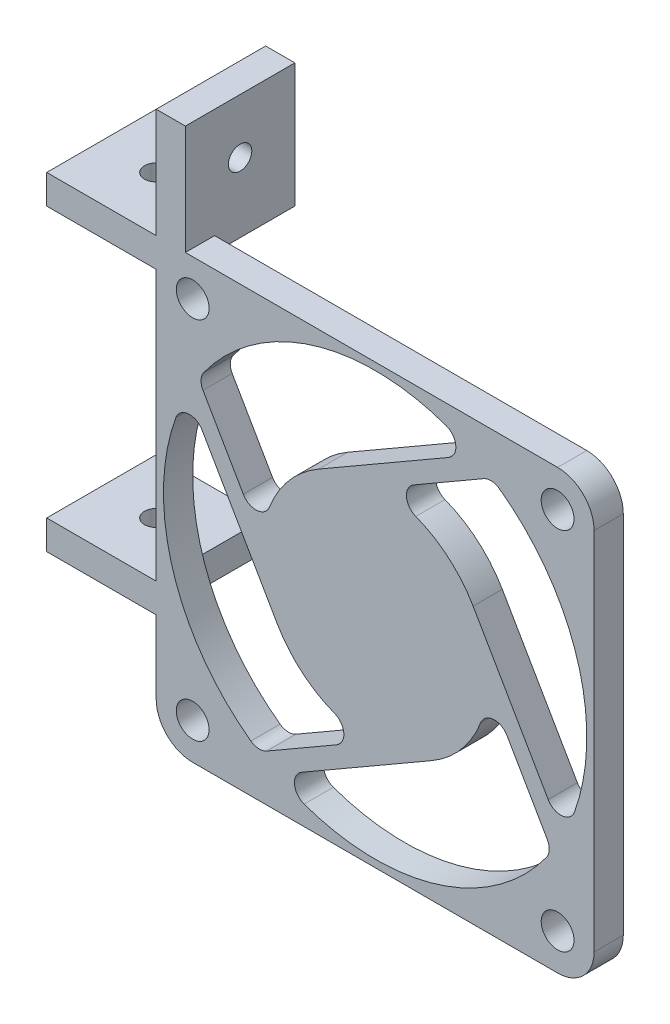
from build123d import *

# Parameters (mm, degrees)
SKETCH1_W           = 60
SKETCH1_H           = 60
SKETCH1_R           = 2.25
BOSS_EXTRUDE1_DEPTH = 4
FILLET1_R           = 5
SKETCH2_W           = 15
SKETCH2_H           = 4
BOSS_EXTRUDE3_DEPTH = 15
SKETCH3_R           = 1.6
CUT_EXTRUDE1_DEPTH  = 98.211110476
SKETCH4_R           = 1.6
CUT_EXTRUDE2_DEPTH  = 87.168439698


with BuildPart() as part:
    # Sketch1 → Boss-Extrude1 (new body)
    with BuildSketch(Plane.XY):
        with Locations((30, 30)):
            Rectangle(SKETCH1_W, SKETCH1_H)
        with Locations((5, 5)):
            Circle(SKETCH1_R, mode=Mode.SUBTRACT)
        with Locations(Location((55, 5, 0), (0, 0, 180))):
            Circle(SKETCH1_R, mode=Mode.SUBTRACT)
        with Locations((55, 55)):
            Circle(SKETCH1_R, mode=Mode.SUBTRACT)
        with Locations(Location((5, 55, 0), (0, 0, 180))):
            Circle(SKETCH1_R, mode=Mode.SUBTRACT)
        with BuildLine():
            Line((22.25, 43.423393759), (40.056248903, 53.703836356))
            ThreePointArc((40.056248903, 53.703836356), (41.048014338, 55.617189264), (39.727082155, 57.320026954))
            ThreePointArc((39.727082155, 57.320026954), (21.413781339, 57.699762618), (6.525995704, 47.028538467))
            ThreePointArc((6.525995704, 47.028538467), (6.147595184, 45.958095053), (6.412841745, 44.854156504))
            Line((6.412841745, 44.854156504), (11.936340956, 35.287175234))
            ThreePointArc((11.936340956, 35.287175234), (13.824349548, 34.293265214), (15.534861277, 35.568640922))
            ThreePointArc((15.534861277, 35.568640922), (18.2185577, 40.072120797), (22.25, 43.423393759))
        make_face(mode=Mode.SUBTRACT)
        with BuildLine():
            Line((44.854156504, 53.587158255), (35.287175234, 48.063659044))
            ThreePointArc((35.287175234, 48.063659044), (34.293265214, 46.175650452), (35.568640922, 44.465138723))
            ThreePointArc((35.568640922, 44.465138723), (40.072120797, 41.7814423), (43.423393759, 37.75))
            Line((43.423393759, 37.75), (53.703836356, 19.943751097))
            ThreePointArc((53.703836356, 19.943751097), (55.617189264, 18.951985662), (57.320026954, 20.272917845))
            ThreePointArc((57.320026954, 20.272917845), (57.699762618, 38.586218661), (47.028538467, 53.474004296))
            ThreePointArc((47.028538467, 53.474004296), (45.958095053, 53.852404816), (44.854156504, 53.587158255))
        make_face(mode=Mode.SUBTRACT)
        with BuildLine():
            Line((53.587158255, 15.145843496), (48.063659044, 24.712824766))
            ThreePointArc((48.063659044, 24.712824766), (46.175650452, 25.706734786), (44.465138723, 24.431359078))
            ThreePointArc((44.465138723, 24.431359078), (41.7814423, 19.927879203), (37.75, 16.576606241))
            Line((37.75, 16.576606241), (19.943751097, 6.296163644))
            ThreePointArc((19.943751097, 6.296163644), (18.951985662, 4.382810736), (20.272917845, 2.679973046))
            ThreePointArc((20.272917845, 2.679973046), (38.586218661, 2.300237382), (53.474004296, 12.971461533))
            ThreePointArc((53.474004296, 12.971461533), (53.852404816, 14.041904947), (53.587158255, 15.145843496))
        make_face(mode=Mode.SUBTRACT)
        with BuildLine():
            Line((15.145843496, 6.412841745), (24.712824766, 11.936340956))
            ThreePointArc((24.712824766, 11.936340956), (25.706734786, 13.824349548), (24.431359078, 15.534861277))
            ThreePointArc((24.431359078, 15.534861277), (19.927879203, 18.2185577), (16.576606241, 22.25))
            Line((16.576606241, 22.25), (6.296163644, 40.056248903))
            ThreePointArc((6.296163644, 40.056248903), (4.382810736, 41.048014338), (2.679973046, 39.727082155))
            ThreePointArc((2.679973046, 39.727082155), (2.300237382, 21.413781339), (12.971461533, 6.525995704))
            ThreePointArc((12.971461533, 6.525995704), (14.041904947, 6.147595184), (15.145843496, 6.412841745))
        make_face(mode=Mode.SUBTRACT)
    extrude(amount=-BOSS_EXTRUDE1_DEPTH)

    # Fillet1
    fillet1_edges = [part.edges().sort_by_distance(p)[0] for p in [
        (60, 60, -2),
        (60, 0, -2),
        (0, 0, -2),
    ]]
    fillet(fillet1_edges, radius=FILLET1_R)

    # Sketch2 → Boss-Extrude3 (add)
    with BuildSketch(Plane.XY):
        with Locations((-7.5, 17)):
            Rectangle(SKETCH2_W, SKETCH2_H)
        Polygon((0, 60), (0, 75), (4, 75), (4, 58), (2, 56), (-15, 56), (-15, 60), align=None)
    extrude(amount=-BOSS_EXTRUDE3_DEPTH)

    # Sketch3 → Cut-Extrude1 (cut, through all)
    with BuildSketch(Plane.ZY):
        with Locations(Location((-7.5, 67.5, 0), (0, 0, 270))):
            Circle(SKETCH3_R)
    extrude(amount=-CUT_EXTRUDE1_DEPTH, mode=Mode.SUBTRACT)

    # Sketch4 → Cut-Extrude2 (cut, through all)
    with BuildSketch(Plane(origin=(0, 60, 0), x_dir=(1, 0, 0), z_dir=(0, 1, 0))):
        with Locations(Location((-7.5, 7.5, 0), (0, 0, 270))):
            Circle(SKETCH4_R)
    extrude(amount=-CUT_EXTRUDE2_DEPTH, mode=Mode.SUBTRACT)


solid = part.part
